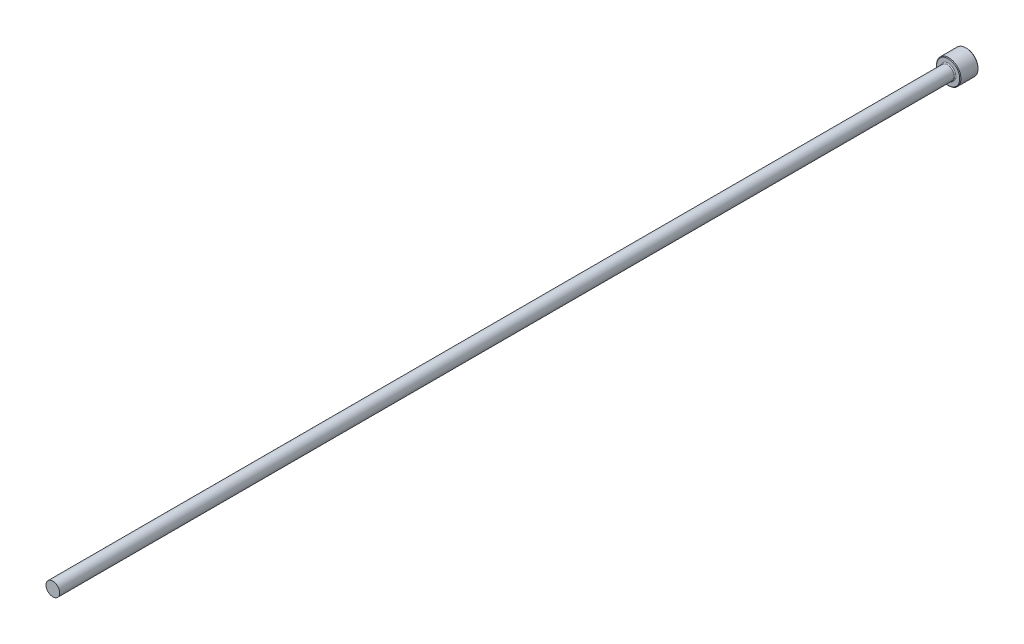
ISO-10303-21;
HEADER;
FILE_DESCRIPTION(('STEP AP214'),'2;1');
FILE_NAME('part.step','',(''),(''),'','','');
FILE_SCHEMA(('AUTOMOTIVE_DESIGN { 1 0 10303 214 1 1 1 1 }'));
ENDSEC;
DATA;
#1=APPLICATION_CONTEXT('core data for automotive mechanical design processes');
#2=APPLICATION_PROTOCOL_DEFINITION('international standard','automotive_design',2000,#1);
#3=PRODUCT_CONTEXT('',#1,'mechanical');
#4=PRODUCT('Part','Part','',(#3));
#5=PRODUCT_RELATED_PRODUCT_CATEGORY('part','',(#4));
#6=PRODUCT_DEFINITION_FORMATION('','',#4);
#7=PRODUCT_DEFINITION_CONTEXT('part definition',#1,'design');
#8=PRODUCT_DEFINITION('design','',#6,#7);
#9=PRODUCT_DEFINITION_SHAPE('','',#8);
#10=(LENGTH_UNIT() NAMED_UNIT(*) SI_UNIT(.MILLI.,.METRE.));
#11=(NAMED_UNIT(*) PLANE_ANGLE_UNIT() SI_UNIT($,.RADIAN.));
#12=(NAMED_UNIT(*) SI_UNIT($,.STERADIAN.) SOLID_ANGLE_UNIT());
#13=UNCERTAINTY_MEASURE_WITH_UNIT(LENGTH_MEASURE(1.E-05),#10,'distance_accuracy_value','');
#14=(GEOMETRIC_REPRESENTATION_CONTEXT(3) GLOBAL_UNCERTAINTY_ASSIGNED_CONTEXT((#13)) GLOBAL_UNIT_ASSIGNED_CONTEXT((#10,
#11,#12)) REPRESENTATION_CONTEXT('',''));
#15=CARTESIAN_POINT('',(0.,0.,0.));
#16=DIRECTION('',(0.,0.,1.));
#17=DIRECTION('',(1.,0.,0.));
#18=AXIS2_PLACEMENT_3D('',#15,#16,#17);
#19=CARTESIAN_POINT('',(0.,2.24999999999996,300.));
#20=DIRECTION('',(0.,0.,-1.));
#21=DIRECTION('',(-1.,0.,0.));
#22=AXIS2_PLACEMENT_3D('',#19,#20,#21);
#23=PLANE('',#22);
#24=CARTESIAN_POINT('',(0.,0.,300.));
#25=DIRECTION('',(0.,0.,1.));
#26=DIRECTION('',(1.,0.,0.));
#27=AXIS2_PLACEMENT_3D('',#24,#25,#26);
#28=CIRCLE('',#27,2.24999999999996);
#29=CARTESIAN_POINT('',(2.24999999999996,0.,300.));
#30=VERTEX_POINT('',#29);
#31=EDGE_CURVE('E50',#30,#30,#28,.T.);
#32=ORIENTED_EDGE('',*,*,#31,.T.);
#33=EDGE_LOOP('',(#32));
#34=FACE_BOUND('',#33,.T.);
#35=ADVANCED_FACE('F30',(#34),#23,.F.);
#36=CARTESIAN_POINT('',(0.,0.,109.050628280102));
#37=DIRECTION('',(0.,0.,1.));
#38=DIRECTION('',(1.,0.,0.));
#39=AXIS2_PLACEMENT_3D('',#36,#37,#38);
#40=CYLINDRICAL_SURFACE('',#39,2.24999999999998);
#41=ORIENTED_EDGE('',*,*,#31,.F.);
#42=EDGE_LOOP('',(#41));
#43=FACE_BOUND('',#42,.T.);
#44=CARTESIAN_POINT('',(0.,0.,6.3));
#45=DIRECTION('',(0.,0.,1.));
#46=DIRECTION('',(1.,0.,0.));
#47=AXIS2_PLACEMENT_3D('',#44,#45,#46);
#48=CIRCLE('',#47,2.25);
#49=CARTESIAN_POINT('',(2.25,0.,6.3));
#50=VERTEX_POINT('',#49);
#51=EDGE_CURVE('E53',#50,#50,#48,.T.);
#52=ORIENTED_EDGE('',*,*,#51,.T.);
#53=EDGE_LOOP('',(#52));
#54=FACE_BOUND('',#53,.T.);
#55=ADVANCED_FACE('F73',(#43,#54),#40,.T.);
#56=CARTESIAN_POINT('',(0.,0.,6.3));
#57=DIRECTION('',(0.,0.,1.));
#58=DIRECTION('',(1.,0.,0.));
#59=AXIS2_PLACEMENT_3D('',#56,#57,#58);
#60=TOROIDAL_SURFACE('',#59,2.55,0.3);
#61=ORIENTED_EDGE('',*,*,#51,.F.);
#62=EDGE_LOOP('',(#61));
#63=FACE_BOUND('',#62,.T.);
#64=CARTESIAN_POINT('',(0.,0.,6.00000000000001));
#65=DIRECTION('',(0.,0.,1.));
#66=DIRECTION('',(1.,0.,0.));
#67=AXIS2_PLACEMENT_3D('',#64,#65,#66);
#68=CIRCLE('',#67,2.55);
#69=CARTESIAN_POINT('',(2.55,0.,6.00000000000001));
#70=VERTEX_POINT('',#69);
#71=EDGE_CURVE('E56',#70,#70,#68,.T.);
#72=ORIENTED_EDGE('',*,*,#71,.T.);
#73=EDGE_LOOP('',(#72));
#74=FACE_BOUND('',#73,.T.);
#75=ADVANCED_FACE('F60',(#63,#74),#60,.F.);
#76=CARTESIAN_POINT('',(0.,4.,6.));
#77=DIRECTION('',(0.,0.,-1.));
#78=DIRECTION('',(-1.,0.,0.));
#79=AXIS2_PLACEMENT_3D('',#76,#77,#78);
#80=PLANE('',#79);
#81=CARTESIAN_POINT('',(0.,0.,6.));
#82=DIRECTION('',(0.,0.,-1.));
#83=DIRECTION('',(-1.,0.,0.));
#84=AXIS2_PLACEMENT_3D('',#81,#82,#83);
#85=CIRCLE('',#84,3.80000000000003);
#86=CARTESIAN_POINT('',(-3.80000000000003,0.,6.));
#87=VERTEX_POINT('',#86);
#88=EDGE_CURVE('E10',#87,#87,#85,.F.);
#89=ORIENTED_EDGE('',*,*,#88,.T.);
#90=EDGE_LOOP('',(#89));
#91=FACE_BOUND('',#90,.T.);
#92=ORIENTED_EDGE('',*,*,#71,.F.);
#93=EDGE_LOOP('',(#92));
#94=FACE_BOUND('',#93,.T.);
#95=ADVANCED_FACE('F62',(#91,#94),#80,.F.);
#96=CARTESIAN_POINT('',(0.,0.,109.050628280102));
#97=DIRECTION('',(0.,0.,1.));
#98=DIRECTION('',(1.,0.,0.));
#99=AXIS2_PLACEMENT_3D('',#96,#97,#98);
#100=CYLINDRICAL_SURFACE('',#99,4.);
#101=CARTESIAN_POINT('',(0.,0.,0.200000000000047));
#102=DIRECTION('',(0.,0.,1.));
#103=DIRECTION('',(1.,0.,0.));
#104=AXIS2_PLACEMENT_3D('',#101,#102,#103);
#105=CIRCLE('',#104,4.);
#106=CARTESIAN_POINT('',(4.,0.,0.200000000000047));
#107=VERTEX_POINT('',#106);
#108=EDGE_CURVE('E41',#107,#107,#105,.T.);
#109=ORIENTED_EDGE('',*,*,#108,.T.);
#110=EDGE_LOOP('',(#109));
#111=FACE_BOUND('',#110,.T.);
#112=CARTESIAN_POINT('',(0.,0.,5.8));
#113=DIRECTION('',(0.,0.,-1.));
#114=DIRECTION('',(-1.,0.,0.));
#115=AXIS2_PLACEMENT_3D('',#112,#113,#114);
#116=CIRCLE('',#115,4.);
#117=CARTESIAN_POINT('',(-4.,0.,5.8));
#118=VERTEX_POINT('',#117);
#119=EDGE_CURVE('E45',#118,#118,#116,.T.);
#120=ORIENTED_EDGE('',*,*,#119,.T.);
#121=EDGE_LOOP('',(#120));
#122=FACE_BOUND('',#121,.T.);
#123=ADVANCED_FACE('F64',(#111,#122),#100,.T.);
#124=CARTESIAN_POINT('',(0.,0.,0.));
#125=DIRECTION('',(0.,0.,1.));
#126=DIRECTION('',(1.,0.,0.));
#127=AXIS2_PLACEMENT_3D('',#124,#125,#126);
#128=PLANE('',#127);
#129=CARTESIAN_POINT('',(0.,0.,0.));
#130=DIRECTION('',(0.,0.,1.));
#131=DIRECTION('',(1.,0.,0.));
#132=AXIS2_PLACEMENT_3D('',#129,#130,#131);
#133=CIRCLE('',#132,3.8);
#134=CARTESIAN_POINT('',(3.8,0.,0.));
#135=VERTEX_POINT('',#134);
#136=EDGE_CURVE('E37',#135,#135,#133,.F.);
#137=ORIENTED_EDGE('',*,*,#136,.T.);
#138=EDGE_LOOP('',(#137));
#139=FACE_BOUND('',#138,.T.);
#140=ADVANCED_FACE('F70',(#139),#128,.F.);
#141=CARTESIAN_POINT('',(0.,0.,0.200000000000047));
#142=DIRECTION('',(0.,0.,1.));
#143=DIRECTION('',(1.,0.,0.));
#144=AXIS2_PLACEMENT_3D('',#141,#142,#143);
#145=CONICAL_SURFACE('',#144,4.,0.785398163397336);
#146=ORIENTED_EDGE('',*,*,#136,.F.);
#147=EDGE_LOOP('',(#146));
#148=FACE_BOUND('',#147,.T.);
#149=ORIENTED_EDGE('',*,*,#108,.F.);
#150=EDGE_LOOP('',(#149));
#151=FACE_BOUND('',#150,.T.);
#152=ADVANCED_FACE('F84',(#148,#151),#145,.T.);
#153=CARTESIAN_POINT('',(0.,0.,6.00000000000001));
#154=DIRECTION('',(0.,0.,-1.));
#155=DIRECTION('',(-1.,0.,0.));
#156=AXIS2_PLACEMENT_3D('',#153,#154,#155);
#157=CONICAL_SURFACE('',#156,3.80000000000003,0.78539816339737);
#158=ORIENTED_EDGE('',*,*,#119,.F.);
#159=EDGE_LOOP('',(#158));
#160=FACE_BOUND('',#159,.T.);
#161=ORIENTED_EDGE('',*,*,#88,.F.);
#162=EDGE_LOOP('',(#161));
#163=FACE_BOUND('',#162,.T.);
#164=ADVANCED_FACE('F32',(#160,#163),#157,.T.);
#165=CLOSED_SHELL('',(#35,#55,#75,#95,#123,#140,#152,#164));
#166=MANIFOLD_SOLID_BREP('B2',#165);
#167=ADVANCED_BREP_SHAPE_REPRESENTATION('',(#18,#166),#14);
#168=SHAPE_DEFINITION_REPRESENTATION(#9,#167);
ENDSEC;
END-ISO-10303-21;
